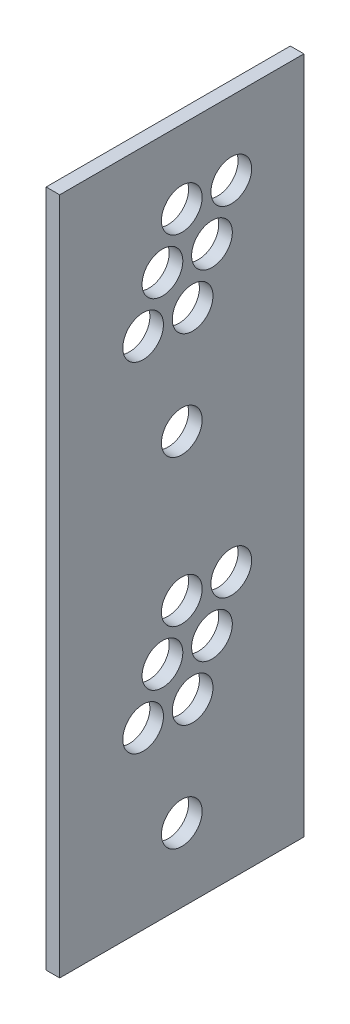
ISO-10303-21;
HEADER;
FILE_DESCRIPTION(('STEP AP214'),'2;1');
FILE_NAME('part.step','',(''),(''),'','','');
FILE_SCHEMA(('AUTOMOTIVE_DESIGN { 1 0 10303 214 1 1 1 1 }'));
ENDSEC;
DATA;
#1=APPLICATION_CONTEXT('core data for automotive mechanical design processes');
#2=APPLICATION_PROTOCOL_DEFINITION('international standard','automotive_design',2000,#1);
#3=PRODUCT_CONTEXT('',#1,'mechanical');
#4=PRODUCT('Part','Part','',(#3));
#5=PRODUCT_RELATED_PRODUCT_CATEGORY('part','',(#4));
#6=PRODUCT_DEFINITION_FORMATION('','',#4);
#7=PRODUCT_DEFINITION_CONTEXT('part definition',#1,'design');
#8=PRODUCT_DEFINITION('design','',#6,#7);
#9=PRODUCT_DEFINITION_SHAPE('','',#8);
#10=(LENGTH_UNIT() NAMED_UNIT(*) SI_UNIT(.MILLI.,.METRE.));
#11=(NAMED_UNIT(*) PLANE_ANGLE_UNIT() SI_UNIT($,.RADIAN.));
#12=(NAMED_UNIT(*) SI_UNIT($,.STERADIAN.) SOLID_ANGLE_UNIT());
#13=UNCERTAINTY_MEASURE_WITH_UNIT(LENGTH_MEASURE(1.E-05),#10,'distance_accuracy_value','');
#14=(GEOMETRIC_REPRESENTATION_CONTEXT(3) GLOBAL_UNCERTAINTY_ASSIGNED_CONTEXT((#13)) GLOBAL_UNIT_ASSIGNED_CONTEXT((#10,
#11,#12)) REPRESENTATION_CONTEXT('',''));
#15=CARTESIAN_POINT('',(0.,0.,0.));
#16=DIRECTION('',(0.,0.,1.));
#17=DIRECTION('',(1.,0.,0.));
#18=AXIS2_PLACEMENT_3D('',#15,#16,#17);
#19=CARTESIAN_POINT('',(-192.695207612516,500.,-4.39119064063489E-13));
#20=DIRECTION('',(0.,-1.,0.));
#21=DIRECTION('',(0.,0.,-1.));
#22=AXIS2_PLACEMENT_3D('',#19,#20,#21);
#23=PLANE('',#22);
#24=DIRECTION('',(0.,0.,-1.));
#25=VECTOR('',#24,1.);
#26=CARTESIAN_POINT('',(-182.695207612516,500.,-4.50498850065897E-13));
#27=LINE('',#26,#25);
#28=CARTESIAN_POINT('',(-182.695207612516,500.,-4.50498850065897E-13));
#29=VERTEX_POINT('',#28);
#30=CARTESIAN_POINT('',(-182.695207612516,500.,-180.));
#31=VERTEX_POINT('',#30);
#32=EDGE_CURVE('E96',#29,#31,#27,.T.);
#33=ORIENTED_EDGE('',*,*,#32,.T.);
#34=DIRECTION('',(1.,0.,0.));
#35=VECTOR('',#34,1.);
#36=CARTESIAN_POINT('',(-192.695207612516,500.,-180.));
#37=LINE('',#36,#35);
#38=CARTESIAN_POINT('',(-192.695207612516,500.,-180.));
#39=VERTEX_POINT('',#38);
#40=EDGE_CURVE('E11',#39,#31,#37,.T.);
#41=ORIENTED_EDGE('',*,*,#40,.F.);
#42=DIRECTION('',(0.,0.,-1.));
#43=VECTOR('',#42,1.);
#44=CARTESIAN_POINT('',(-192.695207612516,500.,-4.39119064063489E-13));
#45=LINE('',#44,#43);
#46=CARTESIAN_POINT('',(-192.695207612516,500.,-4.39119064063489E-13));
#47=VERTEX_POINT('',#46);
#48=EDGE_CURVE('E84',#47,#39,#45,.T.);
#49=ORIENTED_EDGE('',*,*,#48,.F.);
#50=DIRECTION('',(1.,0.,0.));
#51=VECTOR('',#50,1.);
#52=CARTESIAN_POINT('',(-192.695207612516,500.,-4.39119064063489E-13));
#53=LINE('',#52,#51);
#54=EDGE_CURVE('E92',#47,#29,#53,.T.);
#55=ORIENTED_EDGE('',*,*,#54,.T.);
#56=EDGE_LOOP('',(#33,#41,#49,#55));
#57=FACE_BOUND('',#56,.T.);
#58=ADVANCED_FACE('F33',(#57),#23,.F.);
#59=CARTESIAN_POINT('',(-192.695207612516,500.,-180.));
#60=DIRECTION('',(0.,0.,1.));
#61=DIRECTION('',(1.,0.,0.));
#62=AXIS2_PLACEMENT_3D('',#59,#60,#61);
#63=PLANE('',#62);
#64=DIRECTION('',(0.,-1.,0.));
#65=VECTOR('',#64,1.);
#66=CARTESIAN_POINT('',(-182.695207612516,500.,-180.));
#67=LINE('',#66,#65);
#68=CARTESIAN_POINT('',(-182.695207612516,0.,-180.));
#69=VERTEX_POINT('',#68);
#70=EDGE_CURVE('E88',#31,#69,#67,.T.);
#71=ORIENTED_EDGE('',*,*,#70,.T.);
#72=DIRECTION('',(1.,0.,0.));
#73=VECTOR('',#72,1.);
#74=CARTESIAN_POINT('',(-192.695207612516,0.,-180.));
#75=LINE('',#74,#73);
#76=CARTESIAN_POINT('',(-192.695207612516,0.,-180.));
#77=VERTEX_POINT('',#76);
#78=EDGE_CURVE('E41',#77,#69,#75,.T.);
#79=ORIENTED_EDGE('',*,*,#78,.F.);
#80=DIRECTION('',(0.,-1.,0.));
#81=VECTOR('',#80,1.);
#82=CARTESIAN_POINT('',(-192.695207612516,500.,-180.));
#83=LINE('',#82,#81);
#84=EDGE_CURVE('E79',#39,#77,#83,.T.);
#85=ORIENTED_EDGE('',*,*,#84,.F.);
#86=ORIENTED_EDGE('',*,*,#40,.T.);
#87=EDGE_LOOP('',(#71,#79,#85,#86));
#88=FACE_BOUND('',#87,.T.);
#89=ADVANCED_FACE('F87',(#88),#63,.F.);
#90=CARTESIAN_POINT('',(-192.695207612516,0.,-4.39119064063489E-13));
#91=DIRECTION('',(0.,1.,0.));
#92=DIRECTION('',(0.,0.,1.));
#93=AXIS2_PLACEMENT_3D('',#90,#91,#92);
#94=PLANE('',#93);
#95=DIRECTION('',(0.,0.,1.));
#96=VECTOR('',#95,1.);
#97=CARTESIAN_POINT('',(-182.695207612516,0.,-4.50498850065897E-13));
#98=LINE('',#97,#96);
#99=CARTESIAN_POINT('',(-182.695207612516,0.,-4.50498850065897E-13));
#100=VERTEX_POINT('',#99);
#101=EDGE_CURVE('E66',#69,#100,#98,.T.);
#102=ORIENTED_EDGE('',*,*,#101,.T.);
#103=DIRECTION('',(1.,0.,0.));
#104=VECTOR('',#103,1.);
#105=CARTESIAN_POINT('',(-192.695207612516,0.,-4.39119064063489E-13));
#106=LINE('',#105,#104);
#107=CARTESIAN_POINT('',(-192.695207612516,0.,-4.39119064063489E-13));
#108=VERTEX_POINT('',#107);
#109=EDGE_CURVE('E89',#108,#100,#106,.T.);
#110=ORIENTED_EDGE('',*,*,#109,.F.);
#111=DIRECTION('',(0.,0.,1.));
#112=VECTOR('',#111,1.);
#113=CARTESIAN_POINT('',(-192.695207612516,0.,-4.39119064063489E-13));
#114=LINE('',#113,#112);
#115=EDGE_CURVE('E82',#77,#108,#114,.T.);
#116=ORIENTED_EDGE('',*,*,#115,.F.);
#117=ORIENTED_EDGE('',*,*,#78,.T.);
#118=EDGE_LOOP('',(#102,#110,#116,#117));
#119=FACE_BOUND('',#118,.T.);
#120=ADVANCED_FACE('F90',(#119),#94,.F.);
#121=CARTESIAN_POINT('',(-192.695207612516,500.,-4.39119064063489E-13));
#122=DIRECTION('',(0.,0.,-1.));
#123=DIRECTION('',(-1.,0.,0.));
#124=AXIS2_PLACEMENT_3D('',#121,#122,#123);
#125=PLANE('',#124);
#126=DIRECTION('',(0.,1.,0.));
#127=VECTOR('',#126,1.);
#128=CARTESIAN_POINT('',(-182.695207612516,500.,-4.50498850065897E-13));
#129=LINE('',#128,#127);
#130=EDGE_CURVE('E72',#100,#29,#129,.T.);
#131=ORIENTED_EDGE('',*,*,#130,.T.);
#132=ORIENTED_EDGE('',*,*,#54,.F.);
#133=DIRECTION('',(0.,1.,0.));
#134=VECTOR('',#133,1.);
#135=CARTESIAN_POINT('',(-192.695207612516,500.,-4.39119064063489E-13));
#136=LINE('',#135,#134);
#137=EDGE_CURVE('E49',#108,#47,#136,.T.);
#138=ORIENTED_EDGE('',*,*,#137,.F.);
#139=ORIENTED_EDGE('',*,*,#109,.T.);
#140=EDGE_LOOP('',(#131,#132,#138,#139));
#141=FACE_BOUND('',#140,.T.);
#142=ADVANCED_FACE('F104',(#141),#125,.F.);
#143=CARTESIAN_POINT('',(-192.695207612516,0.,2.08577977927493E-13));
#144=DIRECTION('',(-1.,0.,0.));
#145=DIRECTION('',(0.,0.,1.));
#146=AXIS2_PLACEMENT_3D('',#143,#144,#145);
#147=PLANE('',#146);
#148=CARTESIAN_POINT('',(-192.695207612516,304.,-90.0000000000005));
#149=DIRECTION('',(-1.,0.,0.));
#150=DIRECTION('',(0.,0.,1.));
#151=AXIS2_PLACEMENT_3D('',#148,#149,#150);
#152=CIRCLE('',#151,15.);
#153=CARTESIAN_POINT('',(-192.695207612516,304.,-75.0000000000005));
#154=VERTEX_POINT('',#153);
#155=EDGE_CURVE('E147',#154,#154,#152,.T.);
#156=ORIENTED_EDGE('',*,*,#155,.F.);
#157=EDGE_LOOP('',(#156));
#158=FACE_BOUND('',#157,.T.);
#159=CARTESIAN_POINT('',(-192.695207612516,379.,-61.5000000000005));
#160=DIRECTION('',(-1.,0.,0.));
#161=DIRECTION('',(0.,0.,1.));
#162=AXIS2_PLACEMENT_3D('',#159,#160,#161);
#163=CIRCLE('',#162,15.);
#164=CARTESIAN_POINT('',(-192.695207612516,379.,-46.5000000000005));
#165=VERTEX_POINT('',#164);
#166=EDGE_CURVE('E154',#165,#165,#163,.T.);
#167=ORIENTED_EDGE('',*,*,#166,.F.);
#168=EDGE_LOOP('',(#167));
#169=FACE_BOUND('',#168,.T.);
#170=CARTESIAN_POINT('',(-192.695207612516,446.,-90.0000000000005));
#171=DIRECTION('',(-1.,0.,0.));
#172=DIRECTION('',(0.,0.,1.));
#173=AXIS2_PLACEMENT_3D('',#170,#171,#172);
#174=CIRCLE('',#173,15.);
#175=CARTESIAN_POINT('',(-192.695207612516,446.,-75.0000000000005));
#176=VERTEX_POINT('',#175);
#177=EDGE_CURVE('E157',#176,#176,#174,.T.);
#178=ORIENTED_EDGE('',*,*,#177,.F.);
#179=EDGE_LOOP('',(#178));
#180=FACE_BOUND('',#179,.T.);
#181=CARTESIAN_POINT('',(-192.695207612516,379.,-98.0000000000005));
#182=DIRECTION('',(-1.,0.,0.));
#183=DIRECTION('',(0.,0.,1.));
#184=AXIS2_PLACEMENT_3D('',#181,#182,#183);
#185=CIRCLE('',#184,15.);
#186=CARTESIAN_POINT('',(-192.695207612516,379.,-83.0000000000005));
#187=VERTEX_POINT('',#186);
#188=EDGE_CURVE('E160',#187,#187,#185,.T.);
#189=ORIENTED_EDGE('',*,*,#188,.F.);
#190=EDGE_LOOP('',(#189));
#191=FACE_BOUND('',#190,.T.);
#192=CARTESIAN_POINT('',(-192.695207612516,412.5,-112.25));
#193=DIRECTION('',(-1.,0.,0.));
#194=DIRECTION('',(0.,0.,1.));
#195=AXIS2_PLACEMENT_3D('',#192,#193,#194);
#196=CIRCLE('',#195,15.);
#197=CARTESIAN_POINT('',(-192.695207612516,412.5,-97.2500000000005));
#198=VERTEX_POINT('',#197);
#199=EDGE_CURVE('E163',#198,#198,#196,.T.);
#200=ORIENTED_EDGE('',*,*,#199,.F.);
#201=EDGE_LOOP('',(#200));
#202=FACE_BOUND('',#201,.T.);
#203=CARTESIAN_POINT('',(-192.695207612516,446.,-126.5));
#204=DIRECTION('',(-1.,0.,0.));
#205=DIRECTION('',(0.,0.,1.));
#206=AXIS2_PLACEMENT_3D('',#203,#204,#205);
#207=CIRCLE('',#206,15.);
#208=CARTESIAN_POINT('',(-192.695207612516,446.,-111.5));
#209=VERTEX_POINT('',#208);
#210=EDGE_CURVE('E166',#209,#209,#207,.T.);
#211=ORIENTED_EDGE('',*,*,#210,.F.);
#212=EDGE_LOOP('',(#211));
#213=FACE_BOUND('',#212,.T.);
#214=CARTESIAN_POINT('',(-192.695207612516,412.5,-75.7500000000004));
#215=DIRECTION('',(-1.,0.,0.));
#216=DIRECTION('',(0.,0.,1.));
#217=AXIS2_PLACEMENT_3D('',#214,#215,#216);
#218=CIRCLE('',#217,15.);
#219=CARTESIAN_POINT('',(-192.695207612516,412.5,-60.7500000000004));
#220=VERTEX_POINT('',#219);
#221=EDGE_CURVE('E169',#220,#220,#218,.T.);
#222=ORIENTED_EDGE('',*,*,#221,.F.);
#223=EDGE_LOOP('',(#222));
#224=FACE_BOUND('',#223,.T.);
#225=CARTESIAN_POINT('',(-192.695207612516,54.,-90.0000000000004));
#226=DIRECTION('',(-1.,0.,0.));
#227=DIRECTION('',(0.,0.,1.));
#228=AXIS2_PLACEMENT_3D('',#225,#226,#227);
#229=CIRCLE('',#228,15.);
#230=CARTESIAN_POINT('',(-192.695207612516,54.,-75.0000000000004));
#231=VERTEX_POINT('',#230);
#232=EDGE_CURVE('E99',#231,#231,#229,.T.);
#233=ORIENTED_EDGE('',*,*,#232,.F.);
#234=EDGE_LOOP('',(#233));
#235=FACE_BOUND('',#234,.T.);
#236=CARTESIAN_POINT('',(-192.695207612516,129.,-61.5000000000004));
#237=DIRECTION('',(-1.,0.,0.));
#238=DIRECTION('',(0.,0.,1.));
#239=AXIS2_PLACEMENT_3D('',#236,#237,#238);
#240=CIRCLE('',#239,15.);
#241=CARTESIAN_POINT('',(-192.695207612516,129.,-46.5000000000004));
#242=VERTEX_POINT('',#241);
#243=EDGE_CURVE('E112',#242,#242,#240,.T.);
#244=ORIENTED_EDGE('',*,*,#243,.F.);
#245=EDGE_LOOP('',(#244));
#246=FACE_BOUND('',#245,.T.);
#247=CARTESIAN_POINT('',(-192.695207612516,196.,-90.0000000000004));
#248=DIRECTION('',(-1.,0.,0.));
#249=DIRECTION('',(0.,0.,1.));
#250=AXIS2_PLACEMENT_3D('',#247,#248,#249);
#251=CIRCLE('',#250,15.);
#252=CARTESIAN_POINT('',(-192.695207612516,196.,-75.0000000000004));
#253=VERTEX_POINT('',#252);
#254=EDGE_CURVE('E115',#253,#253,#251,.T.);
#255=ORIENTED_EDGE('',*,*,#254,.F.);
#256=EDGE_LOOP('',(#255));
#257=FACE_BOUND('',#256,.T.);
#258=CARTESIAN_POINT('',(-192.695207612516,129.,-98.0000000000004));
#259=DIRECTION('',(-1.,0.,0.));
#260=DIRECTION('',(0.,0.,1.));
#261=AXIS2_PLACEMENT_3D('',#258,#259,#260);
#262=CIRCLE('',#261,15.);
#263=CARTESIAN_POINT('',(-192.695207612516,129.,-83.0000000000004));
#264=VERTEX_POINT('',#263);
#265=EDGE_CURVE('E118',#264,#264,#262,.T.);
#266=ORIENTED_EDGE('',*,*,#265,.F.);
#267=EDGE_LOOP('',(#266));
#268=FACE_BOUND('',#267,.T.);
#269=CARTESIAN_POINT('',(-192.695207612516,162.5,-112.25));
#270=DIRECTION('',(-1.,0.,0.));
#271=DIRECTION('',(0.,0.,1.));
#272=AXIS2_PLACEMENT_3D('',#269,#270,#271);
#273=CIRCLE('',#272,15.);
#274=CARTESIAN_POINT('',(-192.695207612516,162.5,-97.2500000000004));
#275=VERTEX_POINT('',#274);
#276=EDGE_CURVE('E121',#275,#275,#273,.T.);
#277=ORIENTED_EDGE('',*,*,#276,.F.);
#278=EDGE_LOOP('',(#277));
#279=FACE_BOUND('',#278,.T.);
#280=CARTESIAN_POINT('',(-192.695207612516,196.,-126.5));
#281=DIRECTION('',(-1.,0.,0.));
#282=DIRECTION('',(0.,0.,1.));
#283=AXIS2_PLACEMENT_3D('',#280,#281,#282);
#284=CIRCLE('',#283,15.);
#285=CARTESIAN_POINT('',(-192.695207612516,196.,-111.5));
#286=VERTEX_POINT('',#285);
#287=EDGE_CURVE('E124',#286,#286,#284,.T.);
#288=ORIENTED_EDGE('',*,*,#287,.F.);
#289=EDGE_LOOP('',(#288));
#290=FACE_BOUND('',#289,.T.);
#291=CARTESIAN_POINT('',(-192.695207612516,162.5,-75.7500000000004));
#292=DIRECTION('',(-1.,0.,0.));
#293=DIRECTION('',(0.,0.,1.));
#294=AXIS2_PLACEMENT_3D('',#291,#292,#293);
#295=CIRCLE('',#294,15.);
#296=CARTESIAN_POINT('',(-192.695207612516,162.5,-60.7500000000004));
#297=VERTEX_POINT('',#296);
#298=EDGE_CURVE('E127',#297,#297,#295,.T.);
#299=ORIENTED_EDGE('',*,*,#298,.F.);
#300=EDGE_LOOP('',(#299));
#301=FACE_BOUND('',#300,.T.);
#302=ORIENTED_EDGE('',*,*,#48,.T.);
#303=ORIENTED_EDGE('',*,*,#84,.T.);
#304=ORIENTED_EDGE('',*,*,#115,.T.);
#305=ORIENTED_EDGE('',*,*,#137,.T.);
#306=EDGE_LOOP('',(#302,#303,#304,#305));
#307=FACE_BOUND('',#306,.T.);
#308=ADVANCED_FACE('F80',(#158,#169,#180,#191,#202,#213,#224,#235,#246,#257,#268,#279,#290,#301,
#307),#147,.T.);
#309=CARTESIAN_POINT('',(-182.695207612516,0.,1.97198191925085E-13));
#310=DIRECTION('',(-1.,0.,0.));
#311=DIRECTION('',(0.,0.,1.));
#312=AXIS2_PLACEMENT_3D('',#309,#310,#311);
#313=PLANE('',#312);
#314=CARTESIAN_POINT('',(-182.695207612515,304.,-90.0000000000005));
#315=DIRECTION('',(-1.,0.,0.));
#316=DIRECTION('',(0.,0.,1.));
#317=AXIS2_PLACEMENT_3D('',#314,#315,#316);
#318=CIRCLE('',#317,15.);
#319=CARTESIAN_POINT('',(-182.695207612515,304.,-75.0000000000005));
#320=VERTEX_POINT('',#319);
#321=EDGE_CURVE('E172',#320,#320,#318,.T.);
#322=ORIENTED_EDGE('',*,*,#321,.T.);
#323=EDGE_LOOP('',(#322));
#324=FACE_BOUND('',#323,.T.);
#325=CARTESIAN_POINT('',(-182.695207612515,379.,-61.5000000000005));
#326=DIRECTION('',(-1.,0.,0.));
#327=DIRECTION('',(0.,0.,1.));
#328=AXIS2_PLACEMENT_3D('',#325,#326,#327);
#329=CIRCLE('',#328,15.);
#330=CARTESIAN_POINT('',(-182.695207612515,379.,-46.5000000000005));
#331=VERTEX_POINT('',#330);
#332=EDGE_CURVE('E186',#331,#331,#329,.T.);
#333=ORIENTED_EDGE('',*,*,#332,.T.);
#334=EDGE_LOOP('',(#333));
#335=FACE_BOUND('',#334,.T.);
#336=CARTESIAN_POINT('',(-182.695207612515,446.,-90.0000000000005));
#337=DIRECTION('',(-1.,0.,0.));
#338=DIRECTION('',(0.,0.,1.));
#339=AXIS2_PLACEMENT_3D('',#336,#337,#338);
#340=CIRCLE('',#339,15.);
#341=CARTESIAN_POINT('',(-182.695207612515,446.,-75.0000000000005));
#342=VERTEX_POINT('',#341);
#343=EDGE_CURVE('E183',#342,#342,#340,.T.);
#344=ORIENTED_EDGE('',*,*,#343,.T.);
#345=EDGE_LOOP('',(#344));
#346=FACE_BOUND('',#345,.T.);
#347=CARTESIAN_POINT('',(-182.695207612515,379.,-98.0000000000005));
#348=DIRECTION('',(-1.,0.,0.));
#349=DIRECTION('',(0.,0.,1.));
#350=AXIS2_PLACEMENT_3D('',#347,#348,#349);
#351=CIRCLE('',#350,15.);
#352=CARTESIAN_POINT('',(-182.695207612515,379.,-83.0000000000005));
#353=VERTEX_POINT('',#352);
#354=EDGE_CURVE('E176',#353,#353,#351,.T.);
#355=ORIENTED_EDGE('',*,*,#354,.T.);
#356=EDGE_LOOP('',(#355));
#357=FACE_BOUND('',#356,.T.);
#358=CARTESIAN_POINT('',(-182.695207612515,412.5,-112.25));
#359=DIRECTION('',(-1.,0.,0.));
#360=DIRECTION('',(0.,0.,1.));
#361=AXIS2_PLACEMENT_3D('',#358,#359,#360);
#362=CIRCLE('',#361,15.);
#363=CARTESIAN_POINT('',(-182.695207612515,412.5,-97.2500000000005));
#364=VERTEX_POINT('',#363);
#365=EDGE_CURVE('E173',#364,#364,#362,.T.);
#366=ORIENTED_EDGE('',*,*,#365,.T.);
#367=EDGE_LOOP('',(#366));
#368=FACE_BOUND('',#367,.T.);
#369=CARTESIAN_POINT('',(-182.695207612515,446.,-126.5));
#370=DIRECTION('',(-1.,0.,0.));
#371=DIRECTION('',(0.,0.,1.));
#372=AXIS2_PLACEMENT_3D('',#369,#370,#371);
#373=CIRCLE('',#372,15.);
#374=CARTESIAN_POINT('',(-182.695207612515,446.,-111.5));
#375=VERTEX_POINT('',#374);
#376=EDGE_CURVE('E177',#375,#375,#373,.T.);
#377=ORIENTED_EDGE('',*,*,#376,.T.);
#378=EDGE_LOOP('',(#377));
#379=FACE_BOUND('',#378,.T.);
#380=CARTESIAN_POINT('',(-182.695207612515,412.5,-75.7500000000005));
#381=DIRECTION('',(-1.,0.,0.));
#382=DIRECTION('',(0.,0.,1.));
#383=AXIS2_PLACEMENT_3D('',#380,#381,#382);
#384=CIRCLE('',#383,15.);
#385=CARTESIAN_POINT('',(-182.695207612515,412.5,-60.7500000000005));
#386=VERTEX_POINT('',#385);
#387=EDGE_CURVE('E180',#386,#386,#384,.T.);
#388=ORIENTED_EDGE('',*,*,#387,.T.);
#389=EDGE_LOOP('',(#388));
#390=FACE_BOUND('',#389,.T.);
#391=CARTESIAN_POINT('',(-182.695207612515,54.,-90.0000000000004));
#392=DIRECTION('',(-1.,0.,0.));
#393=DIRECTION('',(0.,0.,1.));
#394=AXIS2_PLACEMENT_3D('',#391,#392,#393);
#395=CIRCLE('',#394,15.);
#396=CARTESIAN_POINT('',(-182.695207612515,54.,-75.0000000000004));
#397=VERTEX_POINT('',#396);
#398=EDGE_CURVE('E130',#397,#397,#395,.T.);
#399=ORIENTED_EDGE('',*,*,#398,.T.);
#400=EDGE_LOOP('',(#399));
#401=FACE_BOUND('',#400,.T.);
#402=CARTESIAN_POINT('',(-182.695207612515,129.,-61.5000000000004));
#403=DIRECTION('',(-1.,0.,0.));
#404=DIRECTION('',(0.,0.,1.));
#405=AXIS2_PLACEMENT_3D('',#402,#403,#404);
#406=CIRCLE('',#405,15.);
#407=CARTESIAN_POINT('',(-182.695207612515,129.,-46.5000000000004));
#408=VERTEX_POINT('',#407);
#409=EDGE_CURVE('E144',#408,#408,#406,.T.);
#410=ORIENTED_EDGE('',*,*,#409,.T.);
#411=EDGE_LOOP('',(#410));
#412=FACE_BOUND('',#411,.T.);
#413=CARTESIAN_POINT('',(-182.695207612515,196.,-90.0000000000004));
#414=DIRECTION('',(-1.,0.,0.));
#415=DIRECTION('',(0.,0.,1.));
#416=AXIS2_PLACEMENT_3D('',#413,#414,#415);
#417=CIRCLE('',#416,15.);
#418=CARTESIAN_POINT('',(-182.695207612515,196.,-75.0000000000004));
#419=VERTEX_POINT('',#418);
#420=EDGE_CURVE('E141',#419,#419,#417,.T.);
#421=ORIENTED_EDGE('',*,*,#420,.T.);
#422=EDGE_LOOP('',(#421));
#423=FACE_BOUND('',#422,.T.);
#424=CARTESIAN_POINT('',(-182.695207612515,129.,-98.0000000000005));
#425=DIRECTION('',(-1.,0.,0.));
#426=DIRECTION('',(0.,0.,1.));
#427=AXIS2_PLACEMENT_3D('',#424,#425,#426);
#428=CIRCLE('',#427,15.);
#429=CARTESIAN_POINT('',(-182.695207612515,129.,-83.0000000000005));
#430=VERTEX_POINT('',#429);
#431=EDGE_CURVE('E134',#430,#430,#428,.T.);
#432=ORIENTED_EDGE('',*,*,#431,.T.);
#433=EDGE_LOOP('',(#432));
#434=FACE_BOUND('',#433,.T.);
#435=CARTESIAN_POINT('',(-182.695207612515,162.5,-112.25));
#436=DIRECTION('',(-1.,0.,0.));
#437=DIRECTION('',(0.,0.,1.));
#438=AXIS2_PLACEMENT_3D('',#435,#436,#437);
#439=CIRCLE('',#438,15.);
#440=CARTESIAN_POINT('',(-182.695207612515,162.5,-97.2500000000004));
#441=VERTEX_POINT('',#440);
#442=EDGE_CURVE('E131',#441,#441,#439,.T.);
#443=ORIENTED_EDGE('',*,*,#442,.T.);
#444=EDGE_LOOP('',(#443));
#445=FACE_BOUND('',#444,.T.);
#446=CARTESIAN_POINT('',(-182.695207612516,196.,-126.5));
#447=DIRECTION('',(-1.,0.,0.));
#448=DIRECTION('',(0.,0.,1.));
#449=AXIS2_PLACEMENT_3D('',#446,#447,#448);
#450=CIRCLE('',#449,15.);
#451=CARTESIAN_POINT('',(-182.695207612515,196.,-111.5));
#452=VERTEX_POINT('',#451);
#453=EDGE_CURVE('E135',#452,#452,#450,.T.);
#454=ORIENTED_EDGE('',*,*,#453,.T.);
#455=EDGE_LOOP('',(#454));
#456=FACE_BOUND('',#455,.T.);
#457=CARTESIAN_POINT('',(-182.695207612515,162.5,-75.7500000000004));
#458=DIRECTION('',(-1.,0.,0.));
#459=DIRECTION('',(0.,0.,1.));
#460=AXIS2_PLACEMENT_3D('',#457,#458,#459);
#461=CIRCLE('',#460,15.);
#462=CARTESIAN_POINT('',(-182.695207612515,162.5,-60.7500000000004));
#463=VERTEX_POINT('',#462);
#464=EDGE_CURVE('E138',#463,#463,#461,.T.);
#465=ORIENTED_EDGE('',*,*,#464,.T.);
#466=EDGE_LOOP('',(#465));
#467=FACE_BOUND('',#466,.T.);
#468=ORIENTED_EDGE('',*,*,#32,.F.);
#469=ORIENTED_EDGE('',*,*,#130,.F.);
#470=ORIENTED_EDGE('',*,*,#101,.F.);
#471=ORIENTED_EDGE('',*,*,#70,.F.);
#472=EDGE_LOOP('',(#468,#469,#470,#471));
#473=FACE_BOUND('',#472,.T.);
#474=ADVANCED_FACE('F107',(#324,#335,#346,#357,#368,#379,#390,#401,#412,#423,#434,#445,#456,
#467,#473),#313,.F.);
#475=CARTESIAN_POINT('',(-182.695207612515,162.5,-75.7500000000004));
#476=DIRECTION('',(-1.,0.,0.));
#477=DIRECTION('',(0.,0.,1.));
#478=AXIS2_PLACEMENT_3D('',#475,#476,#477);
#479=CYLINDRICAL_SURFACE('',#478,15.);
#480=ORIENTED_EDGE('',*,*,#298,.T.);
#481=EDGE_LOOP('',(#480));
#482=FACE_BOUND('',#481,.T.);
#483=ORIENTED_EDGE('',*,*,#464,.F.);
#484=EDGE_LOOP('',(#483));
#485=FACE_BOUND('',#484,.T.);
#486=ADVANCED_FACE('F221',(#482,#485),#479,.F.);
#487=CARTESIAN_POINT('',(-182.695207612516,196.,-126.5));
#488=DIRECTION('',(-1.,0.,0.));
#489=DIRECTION('',(0.,0.,1.));
#490=AXIS2_PLACEMENT_3D('',#487,#488,#489);
#491=CYLINDRICAL_SURFACE('',#490,15.);
#492=ORIENTED_EDGE('',*,*,#287,.T.);
#493=EDGE_LOOP('',(#492));
#494=FACE_BOUND('',#493,.T.);
#495=ORIENTED_EDGE('',*,*,#453,.F.);
#496=EDGE_LOOP('',(#495));
#497=FACE_BOUND('',#496,.T.);
#498=ADVANCED_FACE('F229',(#494,#497),#491,.F.);
#499=CARTESIAN_POINT('',(-182.695207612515,162.5,-112.25));
#500=DIRECTION('',(-1.,0.,0.));
#501=DIRECTION('',(0.,0.,1.));
#502=AXIS2_PLACEMENT_3D('',#499,#500,#501);
#503=CYLINDRICAL_SURFACE('',#502,15.);
#504=ORIENTED_EDGE('',*,*,#276,.T.);
#505=EDGE_LOOP('',(#504));
#506=FACE_BOUND('',#505,.T.);
#507=ORIENTED_EDGE('',*,*,#442,.F.);
#508=EDGE_LOOP('',(#507));
#509=FACE_BOUND('',#508,.T.);
#510=ADVANCED_FACE('F225',(#506,#509),#503,.F.);
#511=CARTESIAN_POINT('',(-182.695207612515,129.,-98.0000000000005));
#512=DIRECTION('',(-1.,0.,0.));
#513=DIRECTION('',(0.,0.,1.));
#514=AXIS2_PLACEMENT_3D('',#511,#512,#513);
#515=CYLINDRICAL_SURFACE('',#514,15.);
#516=ORIENTED_EDGE('',*,*,#265,.T.);
#517=EDGE_LOOP('',(#516));
#518=FACE_BOUND('',#517,.T.);
#519=ORIENTED_EDGE('',*,*,#431,.F.);
#520=EDGE_LOOP('',(#519));
#521=FACE_BOUND('',#520,.T.);
#522=ADVANCED_FACE('F228',(#518,#521),#515,.F.);
#523=CARTESIAN_POINT('',(-182.695207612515,196.,-90.0000000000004));
#524=DIRECTION('',(-1.,0.,0.));
#525=DIRECTION('',(0.,0.,1.));
#526=AXIS2_PLACEMENT_3D('',#523,#524,#525);
#527=CYLINDRICAL_SURFACE('',#526,15.);
#528=ORIENTED_EDGE('',*,*,#254,.T.);
#529=EDGE_LOOP('',(#528));
#530=FACE_BOUND('',#529,.T.);
#531=ORIENTED_EDGE('',*,*,#420,.F.);
#532=EDGE_LOOP('',(#531));
#533=FACE_BOUND('',#532,.T.);
#534=ADVANCED_FACE('F233',(#530,#533),#527,.F.);
#535=CARTESIAN_POINT('',(-182.695207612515,129.,-61.5000000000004));
#536=DIRECTION('',(-1.,0.,0.));
#537=DIRECTION('',(0.,0.,1.));
#538=AXIS2_PLACEMENT_3D('',#535,#536,#537);
#539=CYLINDRICAL_SURFACE('',#538,15.);
#540=ORIENTED_EDGE('',*,*,#243,.T.);
#541=EDGE_LOOP('',(#540));
#542=FACE_BOUND('',#541,.T.);
#543=ORIENTED_EDGE('',*,*,#409,.F.);
#544=EDGE_LOOP('',(#543));
#545=FACE_BOUND('',#544,.T.);
#546=ADVANCED_FACE('F241',(#542,#545),#539,.F.);
#547=CARTESIAN_POINT('',(-182.695207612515,54.,-90.0000000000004));
#548=DIRECTION('',(-1.,0.,0.));
#549=DIRECTION('',(0.,0.,1.));
#550=AXIS2_PLACEMENT_3D('',#547,#548,#549);
#551=CYLINDRICAL_SURFACE('',#550,15.);
#552=ORIENTED_EDGE('',*,*,#232,.T.);
#553=EDGE_LOOP('',(#552));
#554=FACE_BOUND('',#553,.T.);
#555=ORIENTED_EDGE('',*,*,#398,.F.);
#556=EDGE_LOOP('',(#555));
#557=FACE_BOUND('',#556,.T.);
#558=ADVANCED_FACE('F244',(#554,#557),#551,.F.);
#559=CARTESIAN_POINT('',(-182.695207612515,412.5,-75.7500000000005));
#560=DIRECTION('',(-1.,0.,0.));
#561=DIRECTION('',(0.,0.,1.));
#562=AXIS2_PLACEMENT_3D('',#559,#560,#561);
#563=CYLINDRICAL_SURFACE('',#562,15.);
#564=ORIENTED_EDGE('',*,*,#221,.T.);
#565=EDGE_LOOP('',(#564));
#566=FACE_BOUND('',#565,.T.);
#567=ORIENTED_EDGE('',*,*,#387,.F.);
#568=EDGE_LOOP('',(#567));
#569=FACE_BOUND('',#568,.T.);
#570=ADVANCED_FACE('F251',(#566,#569),#563,.F.);
#571=CARTESIAN_POINT('',(-182.695207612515,446.,-126.5));
#572=DIRECTION('',(-1.,0.,0.));
#573=DIRECTION('',(0.,0.,1.));
#574=AXIS2_PLACEMENT_3D('',#571,#572,#573);
#575=CYLINDRICAL_SURFACE('',#574,15.);
#576=ORIENTED_EDGE('',*,*,#210,.T.);
#577=EDGE_LOOP('',(#576));
#578=FACE_BOUND('',#577,.T.);
#579=ORIENTED_EDGE('',*,*,#376,.F.);
#580=EDGE_LOOP('',(#579));
#581=FACE_BOUND('',#580,.T.);
#582=ADVANCED_FACE('F257',(#578,#581),#575,.F.);
#583=CARTESIAN_POINT('',(-182.695207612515,412.5,-112.25));
#584=DIRECTION('',(-1.,0.,0.));
#585=DIRECTION('',(0.,0.,1.));
#586=AXIS2_PLACEMENT_3D('',#583,#584,#585);
#587=CYLINDRICAL_SURFACE('',#586,15.);
#588=ORIENTED_EDGE('',*,*,#199,.T.);
#589=EDGE_LOOP('',(#588));
#590=FACE_BOUND('',#589,.T.);
#591=ORIENTED_EDGE('',*,*,#365,.F.);
#592=EDGE_LOOP('',(#591));
#593=FACE_BOUND('',#592,.T.);
#594=ADVANCED_FACE('F253',(#590,#593),#587,.F.);
#595=CARTESIAN_POINT('',(-182.695207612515,379.,-98.0000000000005));
#596=DIRECTION('',(-1.,0.,0.));
#597=DIRECTION('',(0.,0.,1.));
#598=AXIS2_PLACEMENT_3D('',#595,#596,#597);
#599=CYLINDRICAL_SURFACE('',#598,15.);
#600=ORIENTED_EDGE('',*,*,#188,.T.);
#601=EDGE_LOOP('',(#600));
#602=FACE_BOUND('',#601,.T.);
#603=ORIENTED_EDGE('',*,*,#354,.F.);
#604=EDGE_LOOP('',(#603));
#605=FACE_BOUND('',#604,.T.);
#606=ADVANCED_FACE('F256',(#602,#605),#599,.F.);
#607=CARTESIAN_POINT('',(-182.695207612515,446.,-90.0000000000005));
#608=DIRECTION('',(-1.,0.,0.));
#609=DIRECTION('',(0.,0.,1.));
#610=AXIS2_PLACEMENT_3D('',#607,#608,#609);
#611=CYLINDRICAL_SURFACE('',#610,15.);
#612=ORIENTED_EDGE('',*,*,#177,.T.);
#613=EDGE_LOOP('',(#612));
#614=FACE_BOUND('',#613,.T.);
#615=ORIENTED_EDGE('',*,*,#343,.F.);
#616=EDGE_LOOP('',(#615));
#617=FACE_BOUND('',#616,.T.);
#618=ADVANCED_FACE('F204',(#614,#617),#611,.F.);
#619=CARTESIAN_POINT('',(-182.695207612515,379.,-61.5000000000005));
#620=DIRECTION('',(-1.,0.,0.));
#621=DIRECTION('',(0.,0.,1.));
#622=AXIS2_PLACEMENT_3D('',#619,#620,#621);
#623=CYLINDRICAL_SURFACE('',#622,15.);
#624=ORIENTED_EDGE('',*,*,#166,.T.);
#625=EDGE_LOOP('',(#624));
#626=FACE_BOUND('',#625,.T.);
#627=ORIENTED_EDGE('',*,*,#332,.F.);
#628=EDGE_LOOP('',(#627));
#629=FACE_BOUND('',#628,.T.);
#630=ADVANCED_FACE('F198',(#626,#629),#623,.F.);
#631=CARTESIAN_POINT('',(-182.695207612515,304.,-90.0000000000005));
#632=DIRECTION('',(-1.,0.,0.));
#633=DIRECTION('',(0.,0.,1.));
#634=AXIS2_PLACEMENT_3D('',#631,#632,#633);
#635=CYLINDRICAL_SURFACE('',#634,15.);
#636=ORIENTED_EDGE('',*,*,#155,.T.);
#637=EDGE_LOOP('',(#636));
#638=FACE_BOUND('',#637,.T.);
#639=ORIENTED_EDGE('',*,*,#321,.F.);
#640=EDGE_LOOP('',(#639));
#641=FACE_BOUND('',#640,.T.);
#642=ADVANCED_FACE('F196',(#638,#641),#635,.F.);
#643=CLOSED_SHELL('',(#58,#89,#120,#142,#308,#474,#486,#498,#510,#522,#534,#546,#558,#570,#582,
#594,#606,#618,#630,#642));
#644=MANIFOLD_SOLID_BREP('B2',#643);
#645=ADVANCED_BREP_SHAPE_REPRESENTATION('',(#18,#644),#14);
#646=SHAPE_DEFINITION_REPRESENTATION(#9,#645);
ENDSEC;
END-ISO-10303-21;
